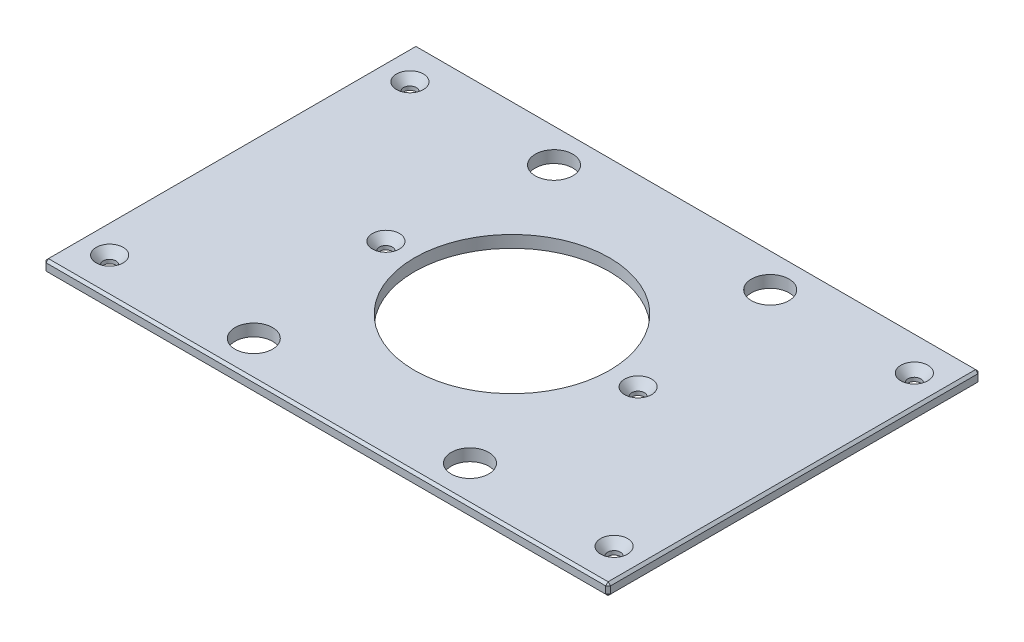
ISO-10303-21;
HEADER;
FILE_DESCRIPTION(('STEP AP214'),'2;1');
FILE_NAME('part.step','',(''),(''),'','','');
FILE_SCHEMA(('AUTOMOTIVE_DESIGN { 1 0 10303 214 1 1 1 1 }'));
ENDSEC;
DATA;
#1=APPLICATION_CONTEXT('core data for automotive mechanical design processes');
#2=APPLICATION_PROTOCOL_DEFINITION('international standard','automotive_design',2000,#1);
#3=PRODUCT_CONTEXT('',#1,'mechanical');
#4=PRODUCT('Part','Part','',(#3));
#5=PRODUCT_RELATED_PRODUCT_CATEGORY('part','',(#4));
#6=PRODUCT_DEFINITION_FORMATION('','',#4);
#7=PRODUCT_DEFINITION_CONTEXT('part definition',#1,'design');
#8=PRODUCT_DEFINITION('design','',#6,#7);
#9=PRODUCT_DEFINITION_SHAPE('','',#8);
#10=(LENGTH_UNIT() NAMED_UNIT(*) SI_UNIT(.MILLI.,.METRE.));
#11=(NAMED_UNIT(*) PLANE_ANGLE_UNIT() SI_UNIT($,.RADIAN.));
#12=(NAMED_UNIT(*) SI_UNIT($,.STERADIAN.) SOLID_ANGLE_UNIT());
#13=UNCERTAINTY_MEASURE_WITH_UNIT(LENGTH_MEASURE(1.E-05),#10,'distance_accuracy_value','');
#14=(GEOMETRIC_REPRESENTATION_CONTEXT(3) GLOBAL_UNCERTAINTY_ASSIGNED_CONTEXT((#13)) GLOBAL_UNIT_ASSIGNED_CONTEXT((#10,
#11,#12)) REPRESENTATION_CONTEXT('',''));
#15=CARTESIAN_POINT('',(0.,0.,0.));
#16=DIRECTION('',(0.,0.,1.));
#17=DIRECTION('',(1.,0.,0.));
#18=AXIS2_PLACEMENT_3D('',#15,#16,#17);
#19=CARTESIAN_POINT('',(-149.225,6.35,-98.425));
#20=DIRECTION('',(1.,0.,0.));
#21=DIRECTION('',(0.,0.,-1.));
#22=AXIS2_PLACEMENT_3D('',#19,#20,#21);
#23=PLANE('',#22);
#24=DIRECTION('',(0.,0.,-1.));
#25=VECTOR('',#24,1.);
#26=CARTESIAN_POINT('',(-149.225,5.08000000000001,-98.425));
#27=LINE('',#26,#25);
#28=CARTESIAN_POINT('',(-149.225,5.08000000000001,97.155));
#29=VERTEX_POINT('',#28);
#30=CARTESIAN_POINT('',(-149.225,5.08000000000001,-97.155));
#31=VERTEX_POINT('',#30);
#32=EDGE_CURVE('E135',#29,#31,#27,.T.);
#33=ORIENTED_EDGE('',*,*,#32,.T.);
#34=DIRECTION('',(0.,-1.,0.));
#35=VECTOR('',#34,1.);
#36=CARTESIAN_POINT('',(-149.225,6.35,-97.155));
#37=LINE('',#36,#35);
#38=CARTESIAN_POINT('',(-149.225,1.26999999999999,-97.155));
#39=VERTEX_POINT('',#38);
#40=EDGE_CURVE('E131',#31,#39,#37,.T.);
#41=ORIENTED_EDGE('',*,*,#40,.T.);
#42=DIRECTION('',(0.,0.,1.));
#43=VECTOR('',#42,1.);
#44=CARTESIAN_POINT('',(-149.225,1.26999999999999,-98.425));
#45=LINE('',#44,#43);
#46=CARTESIAN_POINT('',(-149.225,1.26999999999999,97.155));
#47=VERTEX_POINT('',#46);
#48=EDGE_CURVE('E126',#39,#47,#45,.T.);
#49=ORIENTED_EDGE('',*,*,#48,.T.);
#50=DIRECTION('',(0.,1.,0.));
#51=VECTOR('',#50,1.);
#52=CARTESIAN_POINT('',(-149.225,6.35,97.155));
#53=LINE('',#52,#51);
#54=EDGE_CURVE('E128',#47,#29,#53,.T.);
#55=ORIENTED_EDGE('',*,*,#54,.T.);
#56=EDGE_LOOP('',(#33,#41,#49,#55));
#57=FACE_BOUND('',#56,.T.);
#58=ADVANCED_FACE('F35',(#57),#23,.F.);
#59=CARTESIAN_POINT('',(-149.225,6.35,98.425));
#60=DIRECTION('',(0.,0.,-1.));
#61=DIRECTION('',(-1.,0.,0.));
#62=AXIS2_PLACEMENT_3D('',#59,#60,#61);
#63=PLANE('',#62);
#64=DIRECTION('',(1.,0.,0.));
#65=VECTOR('',#64,1.);
#66=CARTESIAN_POINT('',(-149.225,1.26999999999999,98.425));
#67=LINE('',#66,#65);
#68=CARTESIAN_POINT('',(-147.955,1.26999999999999,98.425));
#69=VERTEX_POINT('',#68);
#70=CARTESIAN_POINT('',(147.955,1.26999999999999,98.425));
#71=VERTEX_POINT('',#70);
#72=EDGE_CURVE('E58',#69,#71,#67,.T.);
#73=ORIENTED_EDGE('',*,*,#72,.T.);
#74=DIRECTION('',(0.,1.,0.));
#75=VECTOR('',#74,1.);
#76=CARTESIAN_POINT('',(147.955,6.35,98.425));
#77=LINE('',#76,#75);
#78=CARTESIAN_POINT('',(147.955,5.08000000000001,98.425));
#79=VERTEX_POINT('',#78);
#80=EDGE_CURVE('E11',#71,#79,#77,.T.);
#81=ORIENTED_EDGE('',*,*,#80,.T.);
#82=DIRECTION('',(-1.,0.,0.));
#83=VECTOR('',#82,1.);
#84=CARTESIAN_POINT('',(-149.225,5.08000000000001,98.425));
#85=LINE('',#84,#83);
#86=CARTESIAN_POINT('',(-147.955,5.08000000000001,98.425));
#87=VERTEX_POINT('',#86);
#88=EDGE_CURVE('E44',#79,#87,#85,.T.);
#89=ORIENTED_EDGE('',*,*,#88,.T.);
#90=DIRECTION('',(0.,-1.,0.));
#91=VECTOR('',#90,1.);
#92=CARTESIAN_POINT('',(-147.955,6.35,98.425));
#93=LINE('',#92,#91);
#94=EDGE_CURVE('E279',#87,#69,#93,.T.);
#95=ORIENTED_EDGE('',*,*,#94,.T.);
#96=EDGE_LOOP('',(#73,#81,#89,#95));
#97=FACE_BOUND('',#96,.T.);
#98=ADVANCED_FACE('F348',(#97),#63,.F.);
#99=CARTESIAN_POINT('',(149.225,6.35,-98.425));
#100=DIRECTION('',(-1.,0.,0.));
#101=DIRECTION('',(0.,0.,1.));
#102=AXIS2_PLACEMENT_3D('',#99,#100,#101);
#103=PLANE('',#102);
#104=DIRECTION('',(0.,0.,-1.));
#105=VECTOR('',#104,1.);
#106=CARTESIAN_POINT('',(149.225,1.26999999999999,-98.425));
#107=LINE('',#106,#105);
#108=CARTESIAN_POINT('',(149.225,1.26999999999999,97.155));
#109=VERTEX_POINT('',#108);
#110=CARTESIAN_POINT('',(149.225,1.26999999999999,-97.155));
#111=VERTEX_POINT('',#110);
#112=EDGE_CURVE('E274',#109,#111,#107,.T.);
#113=ORIENTED_EDGE('',*,*,#112,.T.);
#114=DIRECTION('',(0.,1.,0.));
#115=VECTOR('',#114,1.);
#116=CARTESIAN_POINT('',(149.225,6.35,-97.155));
#117=LINE('',#116,#115);
#118=CARTESIAN_POINT('',(149.225,5.08000000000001,-97.155));
#119=VERTEX_POINT('',#118);
#120=EDGE_CURVE('E276',#111,#119,#117,.T.);
#121=ORIENTED_EDGE('',*,*,#120,.T.);
#122=DIRECTION('',(0.,0.,1.));
#123=VECTOR('',#122,1.);
#124=CARTESIAN_POINT('',(149.225,5.08000000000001,98.425));
#125=LINE('',#124,#123);
#126=CARTESIAN_POINT('',(149.225,5.08000000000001,97.155));
#127=VERTEX_POINT('',#126);
#128=EDGE_CURVE('E272',#119,#127,#125,.T.);
#129=ORIENTED_EDGE('',*,*,#128,.T.);
#130=DIRECTION('',(0.,-1.,0.));
#131=VECTOR('',#130,1.);
#132=CARTESIAN_POINT('',(149.225,6.35,97.155));
#133=LINE('',#132,#131);
#134=EDGE_CURVE('E270',#127,#109,#133,.T.);
#135=ORIENTED_EDGE('',*,*,#134,.T.);
#136=EDGE_LOOP('',(#113,#121,#129,#135));
#137=FACE_BOUND('',#136,.T.);
#138=ADVANCED_FACE('F335',(#137),#103,.F.);
#139=CARTESIAN_POINT('',(-149.225,6.35,-98.425));
#140=DIRECTION('',(0.,0.,1.));
#141=DIRECTION('',(1.,0.,0.));
#142=AXIS2_PLACEMENT_3D('',#139,#140,#141);
#143=PLANE('',#142);
#144=DIRECTION('',(-1.,0.,0.));
#145=VECTOR('',#144,1.);
#146=CARTESIAN_POINT('',(-149.225,1.26999999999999,-98.425));
#147=LINE('',#146,#145);
#148=CARTESIAN_POINT('',(147.955,1.26999999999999,-98.425));
#149=VERTEX_POINT('',#148);
#150=CARTESIAN_POINT('',(-147.955,1.26999999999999,-98.425));
#151=VERTEX_POINT('',#150);
#152=EDGE_CURVE('E246',#149,#151,#147,.T.);
#153=ORIENTED_EDGE('',*,*,#152,.T.);
#154=DIRECTION('',(0.,1.,0.));
#155=VECTOR('',#154,1.);
#156=CARTESIAN_POINT('',(-147.955,6.35,-98.425));
#157=LINE('',#156,#155);
#158=CARTESIAN_POINT('',(-147.955,5.08000000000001,-98.425));
#159=VERTEX_POINT('',#158);
#160=EDGE_CURVE('E250',#151,#159,#157,.T.);
#161=ORIENTED_EDGE('',*,*,#160,.T.);
#162=DIRECTION('',(1.,0.,0.));
#163=VECTOR('',#162,1.);
#164=CARTESIAN_POINT('',(149.225,5.08000000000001,-98.425));
#165=LINE('',#164,#163);
#166=CARTESIAN_POINT('',(147.955,5.08000000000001,-98.425));
#167=VERTEX_POINT('',#166);
#168=EDGE_CURVE('E248',#159,#167,#165,.T.);
#169=ORIENTED_EDGE('',*,*,#168,.T.);
#170=DIRECTION('',(0.,-1.,0.));
#171=VECTOR('',#170,1.);
#172=CARTESIAN_POINT('',(147.955,6.35,-98.425));
#173=LINE('',#172,#171);
#174=EDGE_CURVE('E244',#167,#149,#173,.T.);
#175=ORIENTED_EDGE('',*,*,#174,.T.);
#176=EDGE_LOOP('',(#153,#161,#169,#175));
#177=FACE_BOUND('',#176,.T.);
#178=ADVANCED_FACE('F309',(#177),#143,.F.);
#179=CARTESIAN_POINT('',(0.,6.35,0.));
#180=DIRECTION('',(0.,1.,0.));
#181=DIRECTION('',(0.,0.,1.));
#182=AXIS2_PLACEMENT_3D('',#179,#180,#181);
#183=PLANE('',#182);
#184=CARTESIAN_POINT('',(133.35,6.35,-79.375));
#185=DIRECTION('',(0.,1.,0.));
#186=DIRECTION('',(0.,0.,1.));
#187=AXIS2_PLACEMENT_3D('',#184,#185,#186);
#188=CIRCLE('',#187,7.13739999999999);
#189=CARTESIAN_POINT('',(133.35,6.35,-72.2376));
#190=VERTEX_POINT('',#189);
#191=EDGE_CURVE('E752',#190,#190,#188,.T.);
#192=ORIENTED_EDGE('',*,*,#191,.F.);
#193=EDGE_LOOP('',(#192));
#194=FACE_BOUND('',#193,.T.);
#195=CARTESIAN_POINT('',(133.35,6.35,79.375));
#196=DIRECTION('',(0.,1.,0.));
#197=DIRECTION('',(0.,0.,1.));
#198=AXIS2_PLACEMENT_3D('',#195,#196,#197);
#199=CIRCLE('',#198,7.13739999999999);
#200=CARTESIAN_POINT('',(133.35,6.35,86.5124));
#201=VERTEX_POINT('',#200);
#202=EDGE_CURVE('E756',#201,#201,#199,.T.);
#203=ORIENTED_EDGE('',*,*,#202,.F.);
#204=EDGE_LOOP('',(#203));
#205=FACE_BOUND('',#204,.T.);
#206=CARTESIAN_POINT('',(-133.35,6.35,79.375));
#207=DIRECTION('',(0.,1.,0.));
#208=DIRECTION('',(0.,0.,1.));
#209=AXIS2_PLACEMENT_3D('',#206,#207,#208);
#210=CIRCLE('',#209,7.13739999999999);
#211=CARTESIAN_POINT('',(-133.35,6.35,86.5124));
#212=VERTEX_POINT('',#211);
#213=EDGE_CURVE('E760',#212,#212,#210,.T.);
#214=ORIENTED_EDGE('',*,*,#213,.F.);
#215=EDGE_LOOP('',(#214));
#216=FACE_BOUND('',#215,.T.);
#217=CARTESIAN_POINT('',(-66.675,6.35,0.));
#218=DIRECTION('',(0.,1.,0.));
#219=DIRECTION('',(0.,0.,1.));
#220=AXIS2_PLACEMENT_3D('',#217,#218,#219);
#221=CIRCLE('',#220,7.1374);
#222=CARTESIAN_POINT('',(-66.675,6.35,7.1374));
#223=VERTEX_POINT('',#222);
#224=EDGE_CURVE('E764',#223,#223,#221,.T.);
#225=ORIENTED_EDGE('',*,*,#224,.F.);
#226=EDGE_LOOP('',(#225));
#227=FACE_BOUND('',#226,.T.);
#228=CARTESIAN_POINT('',(66.675,6.35,0.));
#229=DIRECTION('',(0.,1.,0.));
#230=DIRECTION('',(0.,0.,1.));
#231=AXIS2_PLACEMENT_3D('',#228,#229,#230);
#232=CIRCLE('',#231,7.1374);
#233=CARTESIAN_POINT('',(66.675,6.35,7.1374));
#234=VERTEX_POINT('',#233);
#235=EDGE_CURVE('E768',#234,#234,#232,.T.);
#236=ORIENTED_EDGE('',*,*,#235,.F.);
#237=EDGE_LOOP('',(#236));
#238=FACE_BOUND('',#237,.T.);
#239=CARTESIAN_POINT('',(-133.35,6.35,-79.375));
#240=DIRECTION('',(0.,1.,0.));
#241=DIRECTION('',(0.,0.,1.));
#242=AXIS2_PLACEMENT_3D('',#239,#240,#241);
#243=CIRCLE('',#242,7.13739999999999);
#244=CARTESIAN_POINT('',(-133.35,6.35,-72.2376));
#245=VERTEX_POINT('',#244);
#246=EDGE_CURVE('E771',#245,#245,#243,.T.);
#247=ORIENTED_EDGE('',*,*,#246,.F.);
#248=EDGE_LOOP('',(#247));
#249=FACE_BOUND('',#248,.T.);
#250=DIRECTION('',(0.,0.,-1.));
#251=VECTOR('',#250,1.);
#252=CARTESIAN_POINT('',(147.955,6.35,-98.425));
#253=LINE('',#252,#251);
#254=CARTESIAN_POINT('',(147.955,6.35,97.155));
#255=VERTEX_POINT('',#254);
#256=CARTESIAN_POINT('',(147.955,6.35,-97.155));
#257=VERTEX_POINT('',#256);
#258=EDGE_CURVE('E257',#255,#257,#253,.T.);
#259=ORIENTED_EDGE('',*,*,#258,.T.);
#260=DIRECTION('',(-1.,0.,0.));
#261=VECTOR('',#260,1.);
#262=CARTESIAN_POINT('',(-149.225,6.35,-97.155));
#263=LINE('',#262,#261);
#264=CARTESIAN_POINT('',(-147.955,6.35,-97.155));
#265=VERTEX_POINT('',#264);
#266=EDGE_CURVE('E259',#257,#265,#263,.T.);
#267=ORIENTED_EDGE('',*,*,#266,.T.);
#268=DIRECTION('',(0.,0.,1.));
#269=VECTOR('',#268,1.);
#270=CARTESIAN_POINT('',(-147.955,6.35,98.425));
#271=LINE('',#270,#269);
#272=CARTESIAN_POINT('',(-147.955,6.35,97.155));
#273=VERTEX_POINT('',#272);
#274=EDGE_CURVE('E255',#265,#273,#271,.T.);
#275=ORIENTED_EDGE('',*,*,#274,.T.);
#276=DIRECTION('',(1.,0.,0.));
#277=VECTOR('',#276,1.);
#278=CARTESIAN_POINT('',(149.225,6.35,97.155));
#279=LINE('',#278,#277);
#280=EDGE_CURVE('E253',#273,#255,#279,.T.);
#281=ORIENTED_EDGE('',*,*,#280,.T.);
#282=EDGE_LOOP('',(#259,#267,#275,#281));
#283=FACE_BOUND('',#282,.T.);
#284=CARTESIAN_POINT('',(57.15,6.35,-79.375));
#285=DIRECTION('',(0.,1.,0.));
#286=DIRECTION('',(0.,0.,1.));
#287=AXIS2_PLACEMENT_3D('',#284,#285,#286);
#288=CIRCLE('',#287,9.921875);
#289=CARTESIAN_POINT('',(57.15,6.35,-69.453125));
#290=VERTEX_POINT('',#289);
#291=EDGE_CURVE('E204',#290,#290,#288,.T.);
#292=ORIENTED_EDGE('',*,*,#291,.F.);
#293=EDGE_LOOP('',(#292));
#294=FACE_BOUND('',#293,.T.);
#295=CARTESIAN_POINT('',(-57.15,6.35,-79.375));
#296=DIRECTION('',(0.,1.,0.));
#297=DIRECTION('',(0.,0.,1.));
#298=AXIS2_PLACEMENT_3D('',#295,#296,#297);
#299=CIRCLE('',#298,9.921875);
#300=CARTESIAN_POINT('',(-57.15,6.35,-69.453125));
#301=VERTEX_POINT('',#300);
#302=EDGE_CURVE('E214',#301,#301,#299,.T.);
#303=ORIENTED_EDGE('',*,*,#302,.F.);
#304=EDGE_LOOP('',(#303));
#305=FACE_BOUND('',#304,.T.);
#306=CARTESIAN_POINT('',(57.15,6.35,79.375));
#307=DIRECTION('',(0.,1.,0.));
#308=DIRECTION('',(0.,0.,1.));
#309=AXIS2_PLACEMENT_3D('',#306,#307,#308);
#310=CIRCLE('',#309,9.921875);
#311=CARTESIAN_POINT('',(57.15,6.35,89.296875));
#312=VERTEX_POINT('',#311);
#313=EDGE_CURVE('E225',#312,#312,#310,.T.);
#314=ORIENTED_EDGE('',*,*,#313,.F.);
#315=EDGE_LOOP('',(#314));
#316=FACE_BOUND('',#315,.T.);
#317=CARTESIAN_POINT('',(-57.15,6.35,79.375));
#318=DIRECTION('',(0.,1.,0.));
#319=DIRECTION('',(0.,0.,1.));
#320=AXIS2_PLACEMENT_3D('',#317,#318,#319);
#321=CIRCLE('',#320,9.921875);
#322=CARTESIAN_POINT('',(-57.15,6.35,89.296875));
#323=VERTEX_POINT('',#322);
#324=EDGE_CURVE('E231',#323,#323,#321,.T.);
#325=ORIENTED_EDGE('',*,*,#324,.F.);
#326=EDGE_LOOP('',(#325));
#327=FACE_BOUND('',#326,.T.);
#328=CARTESIAN_POINT('',(0.,6.35,0.));
#329=DIRECTION('',(0.,1.,0.));
#330=DIRECTION('',(0.,0.,1.));
#331=AXIS2_PLACEMENT_3D('',#328,#329,#330);
#332=CIRCLE('',#331,51.562);
#333=CARTESIAN_POINT('',(0.,6.35,51.562));
#334=VERTEX_POINT('',#333);
#335=EDGE_CURVE('E237',#334,#334,#332,.T.);
#336=ORIENTED_EDGE('',*,*,#335,.F.);
#337=EDGE_LOOP('',(#336));
#338=FACE_BOUND('',#337,.T.);
#339=ADVANCED_FACE('F357',(#194,#205,#216,#227,#238,#249,#283,#294,#305,#316,#327,#338),#183,.T.);
#340=CARTESIAN_POINT('',(0.,0.,0.));
#341=DIRECTION('',(0.,1.,0.));
#342=DIRECTION('',(0.,0.,1.));
#343=AXIS2_PLACEMENT_3D('',#340,#341,#342);
#344=PLANE('',#343);
#345=CARTESIAN_POINT('',(133.35,0.,-79.375));
#346=DIRECTION('',(0.,1.,0.));
#347=DIRECTION('',(0.,0.,1.));
#348=AXIS2_PLACEMENT_3D('',#345,#346,#347);
#349=CIRCLE('',#348,3.3782);
#350=CARTESIAN_POINT('',(133.35,0.,-75.9968));
#351=VERTEX_POINT('',#350);
#352=EDGE_CURVE('E805',#351,#351,#349,.T.);
#353=ORIENTED_EDGE('',*,*,#352,.T.);
#354=EDGE_LOOP('',(#353));
#355=FACE_BOUND('',#354,.T.);
#356=CARTESIAN_POINT('',(133.35,0.,79.375));
#357=DIRECTION('',(0.,1.,0.));
#358=DIRECTION('',(0.,0.,1.));
#359=AXIS2_PLACEMENT_3D('',#356,#357,#358);
#360=CIRCLE('',#359,3.3782);
#361=CARTESIAN_POINT('',(133.35,0.,82.7532));
#362=VERTEX_POINT('',#361);
#363=EDGE_CURVE('E798',#362,#362,#360,.T.);
#364=ORIENTED_EDGE('',*,*,#363,.T.);
#365=EDGE_LOOP('',(#364));
#366=FACE_BOUND('',#365,.T.);
#367=CARTESIAN_POINT('',(-133.35,0.,79.375));
#368=DIRECTION('',(0.,1.,0.));
#369=DIRECTION('',(0.,0.,1.));
#370=AXIS2_PLACEMENT_3D('',#367,#368,#369);
#371=CIRCLE('',#370,3.3782);
#372=CARTESIAN_POINT('',(-133.35,0.,82.7532));
#373=VERTEX_POINT('',#372);
#374=EDGE_CURVE('E791',#373,#373,#371,.T.);
#375=ORIENTED_EDGE('',*,*,#374,.T.);
#376=EDGE_LOOP('',(#375));
#377=FACE_BOUND('',#376,.T.);
#378=CARTESIAN_POINT('',(-66.675,0.,0.));
#379=DIRECTION('',(0.,1.,0.));
#380=DIRECTION('',(0.,0.,1.));
#381=AXIS2_PLACEMENT_3D('',#378,#379,#380);
#382=CIRCLE('',#381,3.3782);
#383=CARTESIAN_POINT('',(-66.675,0.,3.3782));
#384=VERTEX_POINT('',#383);
#385=EDGE_CURVE('E784',#384,#384,#382,.T.);
#386=ORIENTED_EDGE('',*,*,#385,.T.);
#387=EDGE_LOOP('',(#386));
#388=FACE_BOUND('',#387,.T.);
#389=CARTESIAN_POINT('',(66.675,0.,0.));
#390=DIRECTION('',(0.,1.,0.));
#391=DIRECTION('',(0.,0.,1.));
#392=AXIS2_PLACEMENT_3D('',#389,#390,#391);
#393=CIRCLE('',#392,3.3782);
#394=CARTESIAN_POINT('',(66.675,0.,3.3782));
#395=VERTEX_POINT('',#394);
#396=EDGE_CURVE('E774',#395,#395,#393,.T.);
#397=ORIENTED_EDGE('',*,*,#396,.T.);
#398=EDGE_LOOP('',(#397));
#399=FACE_BOUND('',#398,.T.);
#400=CARTESIAN_POINT('',(-133.35,0.,-79.375));
#401=DIRECTION('',(0.,1.,0.));
#402=DIRECTION('',(0.,0.,1.));
#403=AXIS2_PLACEMENT_3D('',#400,#401,#402);
#404=CIRCLE('',#403,3.3782);
#405=CARTESIAN_POINT('',(-133.35,0.,-75.9968));
#406=VERTEX_POINT('',#405);
#407=EDGE_CURVE('E217',#406,#406,#404,.T.);
#408=ORIENTED_EDGE('',*,*,#407,.T.);
#409=EDGE_LOOP('',(#408));
#410=FACE_BOUND('',#409,.T.);
#411=DIRECTION('',(0.,0.,-1.));
#412=VECTOR('',#411,1.);
#413=CARTESIAN_POINT('',(-147.955,0.,0.));
#414=LINE('',#413,#412);
#415=CARTESIAN_POINT('',(-147.955,0.,97.155));
#416=VERTEX_POINT('',#415);
#417=CARTESIAN_POINT('',(-147.955,0.,-97.155));
#418=VERTEX_POINT('',#417);
#419=EDGE_CURVE('E158',#416,#418,#414,.T.);
#420=ORIENTED_EDGE('',*,*,#419,.T.);
#421=DIRECTION('',(1.,0.,0.));
#422=VECTOR('',#421,1.);
#423=CARTESIAN_POINT('',(0.,0.,-97.155));
#424=LINE('',#423,#422);
#425=CARTESIAN_POINT('',(147.955,0.,-97.155));
#426=VERTEX_POINT('',#425);
#427=EDGE_CURVE('E267',#418,#426,#424,.T.);
#428=ORIENTED_EDGE('',*,*,#427,.T.);
#429=DIRECTION('',(0.,0.,1.));
#430=VECTOR('',#429,1.);
#431=CARTESIAN_POINT('',(147.955,0.,0.));
#432=LINE('',#431,#430);
#433=CARTESIAN_POINT('',(147.955,0.,97.155));
#434=VERTEX_POINT('',#433);
#435=EDGE_CURVE('E265',#426,#434,#432,.T.);
#436=ORIENTED_EDGE('',*,*,#435,.T.);
#437=DIRECTION('',(-1.,0.,0.));
#438=VECTOR('',#437,1.);
#439=CARTESIAN_POINT('',(0.,0.,97.155));
#440=LINE('',#439,#438);
#441=EDGE_CURVE('E262',#434,#416,#440,.T.);
#442=ORIENTED_EDGE('',*,*,#441,.T.);
#443=EDGE_LOOP('',(#420,#428,#436,#442));
#444=FACE_BOUND('',#443,.T.);
#445=CARTESIAN_POINT('',(57.15,0.,-79.375));
#446=DIRECTION('',(0.,1.,0.));
#447=DIRECTION('',(0.,0.,1.));
#448=AXIS2_PLACEMENT_3D('',#445,#446,#447);
#449=CIRCLE('',#448,9.921875);
#450=CARTESIAN_POINT('',(57.15,0.,-69.453125));
#451=VERTEX_POINT('',#450);
#452=EDGE_CURVE('E209',#451,#451,#449,.T.);
#453=ORIENTED_EDGE('',*,*,#452,.T.);
#454=EDGE_LOOP('',(#453));
#455=FACE_BOUND('',#454,.T.);
#456=CARTESIAN_POINT('',(-57.15,0.,-79.375));
#457=DIRECTION('',(0.,1.,0.));
#458=DIRECTION('',(0.,0.,1.));
#459=AXIS2_PLACEMENT_3D('',#456,#457,#458);
#460=CIRCLE('',#459,9.921875);
#461=CARTESIAN_POINT('',(-57.15,0.,-69.453125));
#462=VERTEX_POINT('',#461);
#463=EDGE_CURVE('E222',#462,#462,#460,.T.);
#464=ORIENTED_EDGE('',*,*,#463,.T.);
#465=EDGE_LOOP('',(#464));
#466=FACE_BOUND('',#465,.T.);
#467=CARTESIAN_POINT('',(57.15,0.,79.375));
#468=DIRECTION('',(0.,1.,0.));
#469=DIRECTION('',(0.,0.,1.));
#470=AXIS2_PLACEMENT_3D('',#467,#468,#469);
#471=CIRCLE('',#470,9.921875);
#472=CARTESIAN_POINT('',(57.15,0.,89.296875));
#473=VERTEX_POINT('',#472);
#474=EDGE_CURVE('E228',#473,#473,#471,.T.);
#475=ORIENTED_EDGE('',*,*,#474,.T.);
#476=EDGE_LOOP('',(#475));
#477=FACE_BOUND('',#476,.T.);
#478=CARTESIAN_POINT('',(-57.15,0.,79.375));
#479=DIRECTION('',(0.,1.,0.));
#480=DIRECTION('',(0.,0.,1.));
#481=AXIS2_PLACEMENT_3D('',#478,#479,#480);
#482=CIRCLE('',#481,9.921875);
#483=CARTESIAN_POINT('',(-57.15,0.,89.296875));
#484=VERTEX_POINT('',#483);
#485=EDGE_CURVE('E234',#484,#484,#482,.T.);
#486=ORIENTED_EDGE('',*,*,#485,.T.);
#487=EDGE_LOOP('',(#486));
#488=FACE_BOUND('',#487,.T.);
#489=CARTESIAN_POINT('',(0.,0.,0.));
#490=DIRECTION('',(0.,1.,0.));
#491=DIRECTION('',(0.,0.,1.));
#492=AXIS2_PLACEMENT_3D('',#489,#490,#491);
#493=CIRCLE('',#492,51.562);
#494=CARTESIAN_POINT('',(0.,0.,51.562));
#495=VERTEX_POINT('',#494);
#496=EDGE_CURVE('E147',#495,#495,#493,.T.);
#497=ORIENTED_EDGE('',*,*,#496,.T.);
#498=EDGE_LOOP('',(#497));
#499=FACE_BOUND('',#498,.T.);
#500=ADVANCED_FACE('F322',(#355,#366,#377,#388,#399,#410,#444,#455,#466,#477,#488,#499),#344,.F.);
#501=CARTESIAN_POINT('',(0.,0.,0.));
#502=DIRECTION('',(0.,1.,0.));
#503=DIRECTION('',(0.,0.,1.));
#504=AXIS2_PLACEMENT_3D('',#501,#502,#503);
#505=CYLINDRICAL_SURFACE('',#504,51.562);
#506=ORIENTED_EDGE('',*,*,#496,.F.);
#507=EDGE_LOOP('',(#506));
#508=FACE_BOUND('',#507,.T.);
#509=ORIENTED_EDGE('',*,*,#335,.T.);
#510=EDGE_LOOP('',(#509));
#511=FACE_BOUND('',#510,.T.);
#512=ADVANCED_FACE('F691',(#508,#511),#505,.F.);
#513=CARTESIAN_POINT('',(-57.15,6.35,79.375));
#514=DIRECTION('',(0.,1.,0.));
#515=DIRECTION('',(0.,0.,1.));
#516=AXIS2_PLACEMENT_3D('',#513,#514,#515);
#517=CYLINDRICAL_SURFACE('',#516,9.921875);
#518=ORIENTED_EDGE('',*,*,#485,.F.);
#519=EDGE_LOOP('',(#518));
#520=FACE_BOUND('',#519,.T.);
#521=ORIENTED_EDGE('',*,*,#324,.T.);
#522=EDGE_LOOP('',(#521));
#523=FACE_BOUND('',#522,.T.);
#524=ADVANCED_FACE('F682',(#520,#523),#517,.F.);
#525=CARTESIAN_POINT('',(57.15,6.35,79.375));
#526=DIRECTION('',(0.,1.,0.));
#527=DIRECTION('',(0.,0.,1.));
#528=AXIS2_PLACEMENT_3D('',#525,#526,#527);
#529=CYLINDRICAL_SURFACE('',#528,9.921875);
#530=ORIENTED_EDGE('',*,*,#474,.F.);
#531=EDGE_LOOP('',(#530));
#532=FACE_BOUND('',#531,.T.);
#533=ORIENTED_EDGE('',*,*,#313,.T.);
#534=EDGE_LOOP('',(#533));
#535=FACE_BOUND('',#534,.T.);
#536=ADVANCED_FACE('F673',(#532,#535),#529,.F.);
#537=CARTESIAN_POINT('',(-57.15,6.35,-79.375));
#538=DIRECTION('',(0.,1.,0.));
#539=DIRECTION('',(0.,0.,1.));
#540=AXIS2_PLACEMENT_3D('',#537,#538,#539);
#541=CYLINDRICAL_SURFACE('',#540,9.921875);
#542=ORIENTED_EDGE('',*,*,#463,.F.);
#543=EDGE_LOOP('',(#542));
#544=FACE_BOUND('',#543,.T.);
#545=ORIENTED_EDGE('',*,*,#302,.T.);
#546=EDGE_LOOP('',(#545));
#547=FACE_BOUND('',#546,.T.);
#548=ADVANCED_FACE('F663',(#544,#547),#541,.F.);
#549=CARTESIAN_POINT('',(57.15,6.35,-79.375));
#550=DIRECTION('',(0.,1.,0.));
#551=DIRECTION('',(0.,0.,1.));
#552=AXIS2_PLACEMENT_3D('',#549,#550,#551);
#553=CYLINDRICAL_SURFACE('',#552,9.921875);
#554=ORIENTED_EDGE('',*,*,#452,.F.);
#555=EDGE_LOOP('',(#554));
#556=FACE_BOUND('',#555,.T.);
#557=ORIENTED_EDGE('',*,*,#291,.T.);
#558=EDGE_LOOP('',(#557));
#559=FACE_BOUND('',#558,.T.);
#560=ADVANCED_FACE('F366',(#556,#559),#553,.F.);
#561=CARTESIAN_POINT('',(149.225,6.35,97.155));
#562=DIRECTION('',(-0.707106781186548,0.,-0.707106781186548));
#563=DIRECTION('',(0.,-1.,0.));
#564=AXIS2_PLACEMENT_3D('',#561,#562,#563);
#565=PLANE('',#564);
#566=DIRECTION('',(-0.707106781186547,0.,0.707106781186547));
#567=VECTOR('',#566,1.);
#568=CARTESIAN_POINT('',(149.225,5.08000000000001,97.155));
#569=LINE('',#568,#567);
#570=EDGE_CURVE('E39',#79,#127,#569,.F.);
#571=ORIENTED_EDGE('',*,*,#570,.F.);
#572=ORIENTED_EDGE('',*,*,#80,.F.);
#573=DIRECTION('',(0.707106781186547,0.,-0.707106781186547));
#574=VECTOR('',#573,1.);
#575=CARTESIAN_POINT('',(148.59,1.26999999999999,97.79));
#576=LINE('',#575,#574);
#577=EDGE_CURVE('E197',#109,#71,#576,.F.);
#578=ORIENTED_EDGE('',*,*,#577,.F.);
#579=ORIENTED_EDGE('',*,*,#134,.F.);
#580=EDGE_LOOP('',(#571,#572,#578,#579));
#581=FACE_BOUND('',#580,.T.);
#582=ADVANCED_FACE('F37',(#581),#565,.F.);
#583=CARTESIAN_POINT('',(149.225,5.08000000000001,97.155));
#584=DIRECTION('',(0.577350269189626,0.577350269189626,0.577350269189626));
#585=DIRECTION('',(0.707106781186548,0.,-0.707106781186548));
#586=AXIS2_PLACEMENT_3D('',#583,#584,#585);
#587=PLANE('',#586);
#588=DIRECTION('',(0.,-0.707106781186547,0.707106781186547));
#589=VECTOR('',#588,1.);
#590=CARTESIAN_POINT('',(147.955,5.715,97.79));
#591=LINE('',#590,#589);
#592=EDGE_CURVE('E193',#79,#255,#591,.F.);
#593=ORIENTED_EDGE('',*,*,#592,.F.);
#594=ORIENTED_EDGE('',*,*,#570,.T.);
#595=DIRECTION('',(-0.707106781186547,0.707106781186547,0.));
#596=VECTOR('',#595,1.);
#597=CARTESIAN_POINT('',(149.225,5.08000000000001,97.155));
#598=LINE('',#597,#596);
#599=EDGE_CURVE('E195',#255,#127,#598,.F.);
#600=ORIENTED_EDGE('',*,*,#599,.F.);
#601=EDGE_LOOP('',(#593,#594,#600));
#602=FACE_BOUND('',#601,.T.);
#603=ADVANCED_FACE('F359',(#602),#587,.T.);
#604=CARTESIAN_POINT('',(147.955,0.,97.155));
#605=DIRECTION('',(0.577350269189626,-0.577350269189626,0.577350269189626));
#606=DIRECTION('',(0.707106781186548,0.,-0.707106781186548));
#607=AXIS2_PLACEMENT_3D('',#604,#605,#606);
#608=PLANE('',#607);
#609=DIRECTION('',(-0.707106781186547,-0.707106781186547,0.));
#610=VECTOR('',#609,1.);
#611=CARTESIAN_POINT('',(147.955,0.,97.155));
#612=LINE('',#611,#610);
#613=EDGE_CURVE('E187',#109,#434,#612,.T.);
#614=ORIENTED_EDGE('',*,*,#613,.F.);
#615=ORIENTED_EDGE('',*,*,#577,.T.);
#616=DIRECTION('',(0.,0.707106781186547,0.707106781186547));
#617=VECTOR('',#616,1.);
#618=CARTESIAN_POINT('',(147.955,0.,97.155));
#619=LINE('',#618,#617);
#620=EDGE_CURVE('E190',#434,#71,#619,.T.);
#621=ORIENTED_EDGE('',*,*,#620,.F.);
#622=EDGE_LOOP('',(#614,#615,#621));
#623=FACE_BOUND('',#622,.T.);
#624=ADVANCED_FACE('F328',(#623),#608,.T.);
#625=CARTESIAN_POINT('',(147.955,6.35,0.));
#626=DIRECTION('',(0.707106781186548,0.707106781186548,0.));
#627=DIRECTION('',(0.,0.,1.));
#628=AXIS2_PLACEMENT_3D('',#625,#626,#627);
#629=PLANE('',#628);
#630=ORIENTED_EDGE('',*,*,#599,.T.);
#631=ORIENTED_EDGE('',*,*,#128,.F.);
#632=DIRECTION('',(0.707106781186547,-0.707106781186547,0.));
#633=VECTOR('',#632,1.);
#634=CARTESIAN_POINT('',(148.59,5.715,-97.155));
#635=LINE('',#634,#633);
#636=EDGE_CURVE('E182',#257,#119,#635,.T.);
#637=ORIENTED_EDGE('',*,*,#636,.F.);
#638=ORIENTED_EDGE('',*,*,#258,.F.);
#639=EDGE_LOOP('',(#630,#631,#637,#638));
#640=FACE_BOUND('',#639,.T.);
#641=ADVANCED_FACE('F345',(#640),#629,.T.);
#642=CARTESIAN_POINT('',(0.,6.35,97.155));
#643=DIRECTION('',(0.,0.707106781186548,0.707106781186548));
#644=DIRECTION('',(-1.,0.,0.));
#645=AXIS2_PLACEMENT_3D('',#642,#643,#644);
#646=PLANE('',#645);
#647=ORIENTED_EDGE('',*,*,#592,.T.);
#648=ORIENTED_EDGE('',*,*,#280,.F.);
#649=DIRECTION('',(0.,0.707106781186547,-0.707106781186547));
#650=VECTOR('',#649,1.);
#651=CARTESIAN_POINT('',(-147.955,6.35,97.155));
#652=LINE('',#651,#650);
#653=EDGE_CURVE('E179',#87,#273,#652,.T.);
#654=ORIENTED_EDGE('',*,*,#653,.F.);
#655=ORIENTED_EDGE('',*,*,#88,.F.);
#656=EDGE_LOOP('',(#647,#648,#654,#655));
#657=FACE_BOUND('',#656,.T.);
#658=ADVANCED_FACE('F350',(#657),#646,.T.);
#659=CARTESIAN_POINT('',(-147.955,6.35,98.425));
#660=DIRECTION('',(0.707106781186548,0.,-0.707106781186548));
#661=DIRECTION('',(0.,-1.,0.));
#662=AXIS2_PLACEMENT_3D('',#659,#660,#661);
#663=PLANE('',#662);
#664=DIRECTION('',(0.707106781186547,0.,0.707106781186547));
#665=VECTOR('',#664,1.);
#666=CARTESIAN_POINT('',(-149.225,1.26999999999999,97.155));
#667=LINE('',#666,#665);
#668=EDGE_CURVE('E142',#69,#47,#667,.F.);
#669=ORIENTED_EDGE('',*,*,#668,.F.);
#670=ORIENTED_EDGE('',*,*,#94,.F.);
#671=DIRECTION('',(-0.707106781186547,0.,-0.707106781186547));
#672=VECTOR('',#671,1.);
#673=CARTESIAN_POINT('',(-148.59,5.08000000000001,97.79));
#674=LINE('',#673,#672);
#675=EDGE_CURVE('E145',#29,#87,#674,.F.);
#676=ORIENTED_EDGE('',*,*,#675,.F.);
#677=ORIENTED_EDGE('',*,*,#54,.F.);
#678=EDGE_LOOP('',(#669,#670,#676,#677));
#679=FACE_BOUND('',#678,.T.);
#680=ADVANCED_FACE('F140',(#679),#663,.F.);
#681=CARTESIAN_POINT('',(-149.225,1.26999999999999,98.425));
#682=DIRECTION('',(0.,0.707106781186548,-0.707106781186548));
#683=DIRECTION('',(1.,0.,0.));
#684=AXIS2_PLACEMENT_3D('',#681,#682,#683);
#685=PLANE('',#684);
#686=ORIENTED_EDGE('',*,*,#620,.T.);
#687=ORIENTED_EDGE('',*,*,#72,.F.);
#688=DIRECTION('',(0.,-0.707106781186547,-0.707106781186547));
#689=VECTOR('',#688,1.);
#690=CARTESIAN_POINT('',(-147.955,0.634999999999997,97.79));
#691=LINE('',#690,#689);
#692=EDGE_CURVE('E155',#416,#69,#691,.F.);
#693=ORIENTED_EDGE('',*,*,#692,.F.);
#694=ORIENTED_EDGE('',*,*,#441,.F.);
#695=EDGE_LOOP('',(#686,#687,#693,#694));
#696=FACE_BOUND('',#695,.T.);
#697=ADVANCED_FACE('F327',(#696),#685,.F.);
#698=CARTESIAN_POINT('',(149.225,1.26999999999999,-98.425));
#699=DIRECTION('',(-0.707106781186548,0.707106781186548,0.));
#700=DIRECTION('',(0.,0.,-1.));
#701=AXIS2_PLACEMENT_3D('',#698,#699,#700);
#702=PLANE('',#701);
#703=ORIENTED_EDGE('',*,*,#613,.T.);
#704=ORIENTED_EDGE('',*,*,#435,.F.);
#705=DIRECTION('',(0.707106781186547,0.707106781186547,0.));
#706=VECTOR('',#705,1.);
#707=CARTESIAN_POINT('',(147.955,0.,-97.155));
#708=LINE('',#707,#706);
#709=EDGE_CURVE('E174',#111,#426,#708,.F.);
#710=ORIENTED_EDGE('',*,*,#709,.F.);
#711=ORIENTED_EDGE('',*,*,#112,.F.);
#712=EDGE_LOOP('',(#703,#704,#710,#711));
#713=FACE_BOUND('',#712,.T.);
#714=ADVANCED_FACE('F332',(#713),#702,.F.);
#715=CARTESIAN_POINT('',(147.955,6.35,-98.425));
#716=DIRECTION('',(-0.707106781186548,0.,0.707106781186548));
#717=DIRECTION('',(0.,-1.,0.));
#718=AXIS2_PLACEMENT_3D('',#715,#716,#717);
#719=PLANE('',#718);
#720=DIRECTION('',(0.707106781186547,0.,0.707106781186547));
#721=VECTOR('',#720,1.);
#722=CARTESIAN_POINT('',(147.955,5.08000000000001,-98.425));
#723=LINE('',#722,#721);
#724=EDGE_CURVE('E184',#119,#167,#723,.F.);
#725=ORIENTED_EDGE('',*,*,#724,.F.);
#726=ORIENTED_EDGE('',*,*,#120,.F.);
#727=DIRECTION('',(-0.707106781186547,0.,-0.707106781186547));
#728=VECTOR('',#727,1.);
#729=CARTESIAN_POINT('',(148.59,1.26999999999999,-97.79));
#730=LINE('',#729,#728);
#731=EDGE_CURVE('E171',#149,#111,#730,.F.);
#732=ORIENTED_EDGE('',*,*,#731,.F.);
#733=ORIENTED_EDGE('',*,*,#174,.F.);
#734=EDGE_LOOP('',(#725,#726,#732,#733));
#735=FACE_BOUND('',#734,.T.);
#736=ADVANCED_FACE('F340',(#735),#719,.F.);
#737=CARTESIAN_POINT('',(147.955,5.08000000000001,-98.425));
#738=DIRECTION('',(0.577350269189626,0.577350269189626,-0.577350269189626));
#739=DIRECTION('',(-0.707106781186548,0.,-0.707106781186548));
#740=AXIS2_PLACEMENT_3D('',#737,#738,#739);
#741=PLANE('',#740);
#742=ORIENTED_EDGE('',*,*,#636,.T.);
#743=ORIENTED_EDGE('',*,*,#724,.T.);
#744=DIRECTION('',(0.,0.707106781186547,0.707106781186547));
#745=VECTOR('',#744,1.);
#746=CARTESIAN_POINT('',(147.955,5.08000000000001,-98.425));
#747=LINE('',#746,#745);
#748=EDGE_CURVE('E163',#257,#167,#747,.F.);
#749=ORIENTED_EDGE('',*,*,#748,.F.);
#750=EDGE_LOOP('',(#742,#743,#749));
#751=FACE_BOUND('',#750,.T.);
#752=ADVANCED_FACE('F398',(#751),#741,.T.);
#753=CARTESIAN_POINT('',(-147.955,6.35,97.155));
#754=DIRECTION('',(-0.577350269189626,0.577350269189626,0.577350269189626));
#755=DIRECTION('',(0.707106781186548,0.,0.707106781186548));
#756=AXIS2_PLACEMENT_3D('',#753,#754,#755);
#757=PLANE('',#756);
#758=ORIENTED_EDGE('',*,*,#675,.T.);
#759=ORIENTED_EDGE('',*,*,#653,.T.);
#760=DIRECTION('',(-0.707106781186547,-0.707106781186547,0.));
#761=VECTOR('',#760,1.);
#762=CARTESIAN_POINT('',(-147.955,6.35,97.155));
#763=LINE('',#762,#761);
#764=EDGE_CURVE('E159',#29,#273,#763,.F.);
#765=ORIENTED_EDGE('',*,*,#764,.F.);
#766=EDGE_LOOP('',(#758,#759,#765));
#767=FACE_BOUND('',#766,.T.);
#768=ADVANCED_FACE('F352',(#767),#757,.T.);
#769=CARTESIAN_POINT('',(-149.225,1.26999999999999,97.155));
#770=DIRECTION('',(-0.577350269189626,-0.577350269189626,0.577350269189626));
#771=DIRECTION('',(0.707106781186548,0.,0.707106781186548));
#772=AXIS2_PLACEMENT_3D('',#769,#770,#771);
#773=PLANE('',#772);
#774=ORIENTED_EDGE('',*,*,#692,.T.);
#775=ORIENTED_EDGE('',*,*,#668,.T.);
#776=DIRECTION('',(-0.707106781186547,0.707106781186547,0.));
#777=VECTOR('',#776,1.);
#778=CARTESIAN_POINT('',(-149.225,1.26999999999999,97.155));
#779=LINE('',#778,#777);
#780=EDGE_CURVE('E152',#416,#47,#779,.T.);
#781=ORIENTED_EDGE('',*,*,#780,.F.);
#782=EDGE_LOOP('',(#774,#775,#781));
#783=FACE_BOUND('',#782,.T.);
#784=ADVANCED_FACE('F151',(#783),#773,.T.);
#785=CARTESIAN_POINT('',(147.955,0.,-97.155));
#786=DIRECTION('',(0.577350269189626,-0.577350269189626,-0.577350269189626));
#787=DIRECTION('',(-0.707106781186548,0.,-0.707106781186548));
#788=AXIS2_PLACEMENT_3D('',#785,#786,#787);
#789=PLANE('',#788);
#790=ORIENTED_EDGE('',*,*,#731,.T.);
#791=ORIENTED_EDGE('',*,*,#709,.T.);
#792=DIRECTION('',(0.,-0.707106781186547,0.707106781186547));
#793=VECTOR('',#792,1.);
#794=CARTESIAN_POINT('',(147.955,0.,-97.155));
#795=LINE('',#794,#793);
#796=EDGE_CURVE('E160',#149,#426,#795,.T.);
#797=ORIENTED_EDGE('',*,*,#796,.F.);
#798=EDGE_LOOP('',(#790,#791,#797));
#799=FACE_BOUND('',#798,.T.);
#800=ADVANCED_FACE('F390',(#799),#789,.T.);
#801=CARTESIAN_POINT('',(0.,6.35,-97.155));
#802=DIRECTION('',(0.,0.707106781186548,-0.707106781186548));
#803=DIRECTION('',(1.,0.,0.));
#804=AXIS2_PLACEMENT_3D('',#801,#802,#803);
#805=PLANE('',#804);
#806=ORIENTED_EDGE('',*,*,#748,.T.);
#807=ORIENTED_EDGE('',*,*,#168,.F.);
#808=DIRECTION('',(0.,-0.707106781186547,-0.707106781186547));
#809=VECTOR('',#808,1.);
#810=CARTESIAN_POINT('',(-147.955,5.08000000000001,-98.425));
#811=LINE('',#810,#809);
#812=EDGE_CURVE('E165',#265,#159,#811,.T.);
#813=ORIENTED_EDGE('',*,*,#812,.F.);
#814=ORIENTED_EDGE('',*,*,#266,.F.);
#815=EDGE_LOOP('',(#806,#807,#813,#814));
#816=FACE_BOUND('',#815,.T.);
#817=ADVANCED_FACE('F304',(#816),#805,.T.);
#818=CARTESIAN_POINT('',(-147.955,6.35,0.));
#819=DIRECTION('',(-0.707106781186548,0.707106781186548,0.));
#820=DIRECTION('',(0.,0.,-1.));
#821=AXIS2_PLACEMENT_3D('',#818,#819,#820);
#822=PLANE('',#821);
#823=ORIENTED_EDGE('',*,*,#764,.T.);
#824=ORIENTED_EDGE('',*,*,#274,.F.);
#825=DIRECTION('',(0.707106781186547,0.707106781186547,0.));
#826=VECTOR('',#825,1.);
#827=CARTESIAN_POINT('',(-148.59,5.715,-97.155));
#828=LINE('',#827,#826);
#829=EDGE_CURVE('E293',#31,#265,#828,.T.);
#830=ORIENTED_EDGE('',*,*,#829,.F.);
#831=ORIENTED_EDGE('',*,*,#32,.F.);
#832=EDGE_LOOP('',(#823,#824,#830,#831));
#833=FACE_BOUND('',#832,.T.);
#834=ADVANCED_FACE('F355',(#833),#822,.T.);
#835=CARTESIAN_POINT('',(-149.225,1.26999999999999,-98.425));
#836=DIRECTION('',(0.707106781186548,0.707106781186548,0.));
#837=DIRECTION('',(0.,0.,1.));
#838=AXIS2_PLACEMENT_3D('',#835,#836,#837);
#839=PLANE('',#838);
#840=ORIENTED_EDGE('',*,*,#780,.T.);
#841=ORIENTED_EDGE('',*,*,#48,.F.);
#842=DIRECTION('',(0.707106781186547,-0.707106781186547,0.));
#843=VECTOR('',#842,1.);
#844=CARTESIAN_POINT('',(-149.225,1.26999999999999,-97.155));
#845=LINE('',#844,#843);
#846=EDGE_CURVE('E290',#418,#39,#845,.F.);
#847=ORIENTED_EDGE('',*,*,#846,.F.);
#848=ORIENTED_EDGE('',*,*,#419,.F.);
#849=EDGE_LOOP('',(#840,#841,#847,#848));
#850=FACE_BOUND('',#849,.T.);
#851=ADVANCED_FACE('F157',(#850),#839,.F.);
#852=CARTESIAN_POINT('',(-149.225,1.26999999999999,-98.425));
#853=DIRECTION('',(0.,0.707106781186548,0.707106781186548));
#854=DIRECTION('',(-1.,0.,0.));
#855=AXIS2_PLACEMENT_3D('',#852,#853,#854);
#856=PLANE('',#855);
#857=ORIENTED_EDGE('',*,*,#796,.T.);
#858=ORIENTED_EDGE('',*,*,#427,.F.);
#859=DIRECTION('',(0.,0.707106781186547,-0.707106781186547));
#860=VECTOR('',#859,1.);
#861=CARTESIAN_POINT('',(-147.955,0.634999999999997,-97.79));
#862=LINE('',#861,#860);
#863=EDGE_CURVE('E287',#151,#418,#862,.F.);
#864=ORIENTED_EDGE('',*,*,#863,.F.);
#865=ORIENTED_EDGE('',*,*,#152,.F.);
#866=EDGE_LOOP('',(#857,#858,#864,#865));
#867=FACE_BOUND('',#866,.T.);
#868=ADVANCED_FACE('F319',(#867),#856,.F.);
#869=CARTESIAN_POINT('',(-147.955,5.08000000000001,-98.425));
#870=DIRECTION('',(-0.577350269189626,0.577350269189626,-0.577350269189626));
#871=DIRECTION('',(-0.707106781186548,0.,0.707106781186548));
#872=AXIS2_PLACEMENT_3D('',#869,#870,#871);
#873=PLANE('',#872);
#874=ORIENTED_EDGE('',*,*,#829,.T.);
#875=ORIENTED_EDGE('',*,*,#812,.T.);
#876=DIRECTION('',(0.707106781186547,0.,-0.707106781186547));
#877=VECTOR('',#876,1.);
#878=CARTESIAN_POINT('',(-147.955,5.08000000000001,-98.425));
#879=LINE('',#878,#877);
#880=EDGE_CURVE('E285',#31,#159,#879,.T.);
#881=ORIENTED_EDGE('',*,*,#880,.F.);
#882=EDGE_LOOP('',(#874,#875,#881));
#883=FACE_BOUND('',#882,.T.);
#884=ADVANCED_FACE('F299',(#883),#873,.T.);
#885=CARTESIAN_POINT('',(-149.225,1.26999999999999,-97.155));
#886=DIRECTION('',(-0.577350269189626,-0.577350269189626,-0.577350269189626));
#887=DIRECTION('',(-0.707106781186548,0.,0.707106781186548));
#888=AXIS2_PLACEMENT_3D('',#885,#886,#887);
#889=PLANE('',#888);
#890=ORIENTED_EDGE('',*,*,#863,.T.);
#891=ORIENTED_EDGE('',*,*,#846,.T.);
#892=DIRECTION('',(-0.707106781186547,0.,0.707106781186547));
#893=VECTOR('',#892,1.);
#894=CARTESIAN_POINT('',(-149.225,1.26999999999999,-97.155));
#895=LINE('',#894,#893);
#896=EDGE_CURVE('E283',#151,#39,#895,.T.);
#897=ORIENTED_EDGE('',*,*,#896,.F.);
#898=EDGE_LOOP('',(#890,#891,#897));
#899=FACE_BOUND('',#898,.T.);
#900=ADVANCED_FACE('F316',(#899),#889,.T.);
#901=CARTESIAN_POINT('',(-149.225,6.35,-97.155));
#902=DIRECTION('',(0.707106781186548,0.,0.707106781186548));
#903=DIRECTION('',(0.,-1.,0.));
#904=AXIS2_PLACEMENT_3D('',#901,#902,#903);
#905=PLANE('',#904);
#906=ORIENTED_EDGE('',*,*,#880,.T.);
#907=ORIENTED_EDGE('',*,*,#160,.F.);
#908=ORIENTED_EDGE('',*,*,#896,.T.);
#909=ORIENTED_EDGE('',*,*,#40,.F.);
#910=EDGE_LOOP('',(#906,#907,#908,#909));
#911=FACE_BOUND('',#910,.T.);
#912=ADVANCED_FACE('F314',(#911),#905,.F.);
#913=CARTESIAN_POINT('',(-133.35,6.35,-79.375));
#914=DIRECTION('',(0.,1.,0.));
#915=DIRECTION('',(0.,0.,1.));
#916=AXIS2_PLACEMENT_3D('',#913,#914,#915);
#917=CYLINDRICAL_SURFACE('',#916,3.3782);
#918=ORIENTED_EDGE('',*,*,#407,.F.);
#919=EDGE_LOOP('',(#918));
#920=FACE_BOUND('',#919,.T.);
#921=CARTESIAN_POINT('',(-133.35,2.02553508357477,-79.375));
#922=DIRECTION('',(0.,1.,0.));
#923=DIRECTION('',(0.,0.,1.));
#924=AXIS2_PLACEMENT_3D('',#921,#922,#923);
#925=CIRCLE('',#924,3.3782);
#926=CARTESIAN_POINT('',(-133.35,2.02553508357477,-75.9968));
#927=VERTEX_POINT('',#926);
#928=EDGE_CURVE('E773',#927,#927,#925,.T.);
#929=ORIENTED_EDGE('',*,*,#928,.T.);
#930=EDGE_LOOP('',(#929));
#931=FACE_BOUND('',#930,.T.);
#932=ADVANCED_FACE('F377',(#920,#931),#917,.F.);
#933=CARTESIAN_POINT('',(-133.35,6.35,-79.375));
#934=DIRECTION('',(0.,1.,0.));
#935=DIRECTION('',(0.,0.,1.));
#936=AXIS2_PLACEMENT_3D('',#933,#934,#935);
#937=CONICAL_SURFACE('',#936,7.13739999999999,0.715584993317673);
#938=ORIENTED_EDGE('',*,*,#928,.F.);
#939=EDGE_LOOP('',(#938));
#940=FACE_BOUND('',#939,.T.);
#941=ORIENTED_EDGE('',*,*,#246,.T.);
#942=EDGE_LOOP('',(#941));
#943=FACE_BOUND('',#942,.T.);
#944=ADVANCED_FACE('F487',(#940,#943),#937,.F.);
#945=CARTESIAN_POINT('',(66.675,6.35,0.));
#946=DIRECTION('',(0.,1.,0.));
#947=DIRECTION('',(0.,0.,1.));
#948=AXIS2_PLACEMENT_3D('',#945,#946,#947);
#949=CYLINDRICAL_SURFACE('',#948,3.3782);
#950=ORIENTED_EDGE('',*,*,#396,.F.);
#951=EDGE_LOOP('',(#950));
#952=FACE_BOUND('',#951,.T.);
#953=CARTESIAN_POINT('',(66.675,2.02553508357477,0.));
#954=DIRECTION('',(0.,1.,0.));
#955=DIRECTION('',(0.,0.,1.));
#956=AXIS2_PLACEMENT_3D('',#953,#954,#955);
#957=CIRCLE('',#956,3.3782);
#958=CARTESIAN_POINT('',(66.675,2.02553508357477,3.3782));
#959=VERTEX_POINT('',#958);
#960=EDGE_CURVE('E778',#959,#959,#957,.T.);
#961=ORIENTED_EDGE('',*,*,#960,.T.);
#962=EDGE_LOOP('',(#961));
#963=FACE_BOUND('',#962,.T.);
#964=ADVANCED_FACE('F496',(#952,#963),#949,.F.);
#965=CARTESIAN_POINT('',(66.675,6.35,0.));
#966=DIRECTION('',(0.,1.,0.));
#967=DIRECTION('',(0.,0.,1.));
#968=AXIS2_PLACEMENT_3D('',#965,#966,#967);
#969=CONICAL_SURFACE('',#968,7.1374,0.715584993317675);
#970=ORIENTED_EDGE('',*,*,#960,.F.);
#971=EDGE_LOOP('',(#970));
#972=FACE_BOUND('',#971,.T.);
#973=ORIENTED_EDGE('',*,*,#235,.T.);
#974=EDGE_LOOP('',(#973));
#975=FACE_BOUND('',#974,.T.);
#976=ADVANCED_FACE('F504',(#972,#975),#969,.F.);
#977=CARTESIAN_POINT('',(-66.675,6.35,0.));
#978=DIRECTION('',(0.,1.,0.));
#979=DIRECTION('',(0.,0.,1.));
#980=AXIS2_PLACEMENT_3D('',#977,#978,#979);
#981=CYLINDRICAL_SURFACE('',#980,3.3782);
#982=ORIENTED_EDGE('',*,*,#385,.F.);
#983=EDGE_LOOP('',(#982));
#984=FACE_BOUND('',#983,.T.);
#985=CARTESIAN_POINT('',(-66.675,2.02553508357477,0.));
#986=DIRECTION('',(0.,1.,0.));
#987=DIRECTION('',(0.,0.,1.));
#988=AXIS2_PLACEMENT_3D('',#985,#986,#987);
#989=CIRCLE('',#988,3.3782);
#990=CARTESIAN_POINT('',(-66.675,2.02553508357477,3.3782));
#991=VERTEX_POINT('',#990);
#992=EDGE_CURVE('E787',#991,#991,#989,.T.);
#993=ORIENTED_EDGE('',*,*,#992,.T.);
#994=EDGE_LOOP('',(#993));
#995=FACE_BOUND('',#994,.T.);
#996=ADVANCED_FACE('F512',(#984,#995),#981,.F.);
#997=CARTESIAN_POINT('',(-66.675,6.35,0.));
#998=DIRECTION('',(0.,1.,0.));
#999=DIRECTION('',(0.,0.,1.));
#1000=AXIS2_PLACEMENT_3D('',#997,#998,#999);
#1001=CONICAL_SURFACE('',#1000,7.1374,0.715584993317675);
#1002=ORIENTED_EDGE('',*,*,#992,.F.);
#1003=EDGE_LOOP('',(#1002));
#1004=FACE_BOUND('',#1003,.T.);
#1005=ORIENTED_EDGE('',*,*,#224,.T.);
#1006=EDGE_LOOP('',(#1005));
#1007=FACE_BOUND('',#1006,.T.);
#1008=ADVANCED_FACE('F520',(#1004,#1007),#1001,.F.);
#1009=CARTESIAN_POINT('',(-133.35,6.35,79.375));
#1010=DIRECTION('',(0.,1.,0.));
#1011=DIRECTION('',(0.,0.,1.));
#1012=AXIS2_PLACEMENT_3D('',#1009,#1010,#1011);
#1013=CYLINDRICAL_SURFACE('',#1012,3.3782);
#1014=ORIENTED_EDGE('',*,*,#374,.F.);
#1015=EDGE_LOOP('',(#1014));
#1016=FACE_BOUND('',#1015,.T.);
#1017=CARTESIAN_POINT('',(-133.35,2.02553508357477,79.375));
#1018=DIRECTION('',(0.,1.,0.));
#1019=DIRECTION('',(0.,0.,1.));
#1020=AXIS2_PLACEMENT_3D('',#1017,#1018,#1019);
#1021=CIRCLE('',#1020,3.3782);
#1022=CARTESIAN_POINT('',(-133.35,2.02553508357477,82.7532));
#1023=VERTEX_POINT('',#1022);
#1024=EDGE_CURVE('E794',#1023,#1023,#1021,.T.);
#1025=ORIENTED_EDGE('',*,*,#1024,.T.);
#1026=EDGE_LOOP('',(#1025));
#1027=FACE_BOUND('',#1026,.T.);
#1028=ADVANCED_FACE('F528',(#1016,#1027),#1013,.F.);
#1029=CARTESIAN_POINT('',(-133.35,6.35,79.375));
#1030=DIRECTION('',(0.,1.,0.));
#1031=DIRECTION('',(0.,0.,1.));
#1032=AXIS2_PLACEMENT_3D('',#1029,#1030,#1031);
#1033=CONICAL_SURFACE('',#1032,7.13739999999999,0.715584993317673);
#1034=ORIENTED_EDGE('',*,*,#1024,.F.);
#1035=EDGE_LOOP('',(#1034));
#1036=FACE_BOUND('',#1035,.T.);
#1037=ORIENTED_EDGE('',*,*,#213,.T.);
#1038=EDGE_LOOP('',(#1037));
#1039=FACE_BOUND('',#1038,.T.);
#1040=ADVANCED_FACE('F536',(#1036,#1039),#1033,.F.);
#1041=CARTESIAN_POINT('',(133.35,6.35,79.375));
#1042=DIRECTION('',(0.,1.,0.));
#1043=DIRECTION('',(0.,0.,1.));
#1044=AXIS2_PLACEMENT_3D('',#1041,#1042,#1043);
#1045=CYLINDRICAL_SURFACE('',#1044,3.3782);
#1046=ORIENTED_EDGE('',*,*,#363,.F.);
#1047=EDGE_LOOP('',(#1046));
#1048=FACE_BOUND('',#1047,.T.);
#1049=CARTESIAN_POINT('',(133.35,2.02553508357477,79.375));
#1050=DIRECTION('',(0.,1.,0.));
#1051=DIRECTION('',(0.,0.,1.));
#1052=AXIS2_PLACEMENT_3D('',#1049,#1050,#1051);
#1053=CIRCLE('',#1052,3.3782);
#1054=CARTESIAN_POINT('',(133.35,2.02553508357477,82.7532));
#1055=VERTEX_POINT('',#1054);
#1056=EDGE_CURVE('E801',#1055,#1055,#1053,.T.);
#1057=ORIENTED_EDGE('',*,*,#1056,.T.);
#1058=EDGE_LOOP('',(#1057));
#1059=FACE_BOUND('',#1058,.T.);
#1060=ADVANCED_FACE('F544',(#1048,#1059),#1045,.F.);
#1061=CARTESIAN_POINT('',(133.35,6.35,79.375));
#1062=DIRECTION('',(0.,1.,0.));
#1063=DIRECTION('',(0.,0.,1.));
#1064=AXIS2_PLACEMENT_3D('',#1061,#1062,#1063);
#1065=CONICAL_SURFACE('',#1064,7.13739999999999,0.715584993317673);
#1066=ORIENTED_EDGE('',*,*,#1056,.F.);
#1067=EDGE_LOOP('',(#1066));
#1068=FACE_BOUND('',#1067,.T.);
#1069=ORIENTED_EDGE('',*,*,#202,.T.);
#1070=EDGE_LOOP('',(#1069));
#1071=FACE_BOUND('',#1070,.T.);
#1072=ADVANCED_FACE('F552',(#1068,#1071),#1065,.F.);
#1073=CARTESIAN_POINT('',(133.35,6.35,-79.375));
#1074=DIRECTION('',(0.,1.,0.));
#1075=DIRECTION('',(0.,0.,1.));
#1076=AXIS2_PLACEMENT_3D('',#1073,#1074,#1075);
#1077=CYLINDRICAL_SURFACE('',#1076,3.3782);
#1078=ORIENTED_EDGE('',*,*,#352,.F.);
#1079=EDGE_LOOP('',(#1078));
#1080=FACE_BOUND('',#1079,.T.);
#1081=CARTESIAN_POINT('',(133.35,2.02553508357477,-79.375));
#1082=DIRECTION('',(0.,1.,0.));
#1083=DIRECTION('',(0.,0.,1.));
#1084=AXIS2_PLACEMENT_3D('',#1081,#1082,#1083);
#1085=CIRCLE('',#1084,3.3782);
#1086=CARTESIAN_POINT('',(133.35,2.02553508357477,-75.9968));
#1087=VERTEX_POINT('',#1086);
#1088=EDGE_CURVE('E808',#1087,#1087,#1085,.T.);
#1089=ORIENTED_EDGE('',*,*,#1088,.T.);
#1090=EDGE_LOOP('',(#1089));
#1091=FACE_BOUND('',#1090,.T.);
#1092=ADVANCED_FACE('F560',(#1080,#1091),#1077,.F.);
#1093=CARTESIAN_POINT('',(133.35,6.35,-79.375));
#1094=DIRECTION('',(0.,1.,0.));
#1095=DIRECTION('',(0.,0.,1.));
#1096=AXIS2_PLACEMENT_3D('',#1093,#1094,#1095);
#1097=CONICAL_SURFACE('',#1096,7.13739999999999,0.715584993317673);
#1098=ORIENTED_EDGE('',*,*,#1088,.F.);
#1099=EDGE_LOOP('',(#1098));
#1100=FACE_BOUND('',#1099,.T.);
#1101=ORIENTED_EDGE('',*,*,#191,.T.);
#1102=EDGE_LOOP('',(#1101));
#1103=FACE_BOUND('',#1102,.T.);
#1104=ADVANCED_FACE('F568',(#1100,#1103),#1097,.F.);
#1105=CLOSED_SHELL('',(#58,#98,#138,#178,#339,#500,#512,#524,#536,#548,#560,#582,#603,#624,#641,
#658,#680,#697,#714,#736,#752,#768,#784,#800,#817,#834,#851,#868,#884,#900,#912,#932,#944,#964,
#976,#996,#1008,#1028,#1040,#1060,#1072,#1092,#1104));
#1106=MANIFOLD_SOLID_BREP('B2',#1105);
#1107=ADVANCED_BREP_SHAPE_REPRESENTATION('',(#18,#1106),#14);
#1108=SHAPE_DEFINITION_REPRESENTATION(#9,#1107);
ENDSEC;
END-ISO-10303-21;
